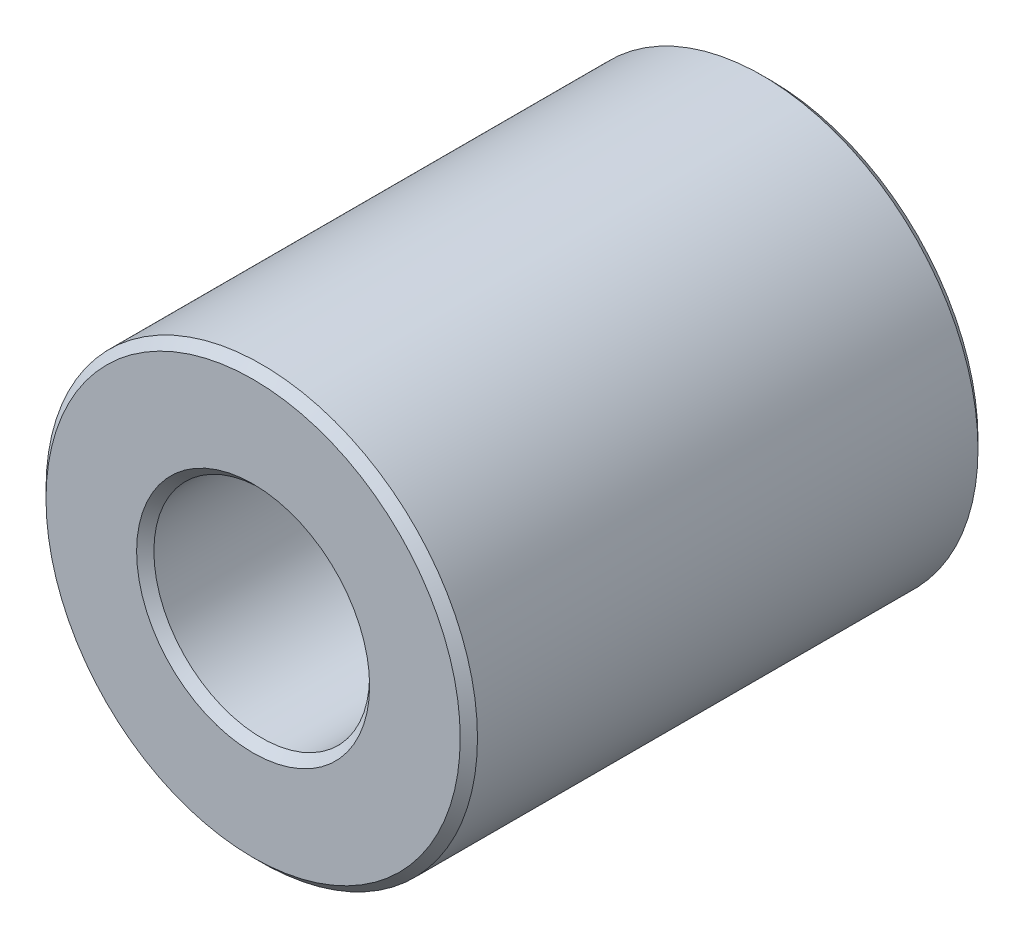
from build123d import *

# Parameters (mm, degrees)
SKETCH1_R           = 2.5
SKETCH1_R_2         = 1.25
BOSS_EXTRUDE2_DEPTH = 3
CHAMFER3_SIZE       = 0.1


with BuildPart() as part:
    # Sketch1 → Boss-Extrude2 (new, symmetric)
    with BuildSketch(Plane.XY):
        Circle(SKETCH1_R)
        Circle(SKETCH1_R_2, mode=Mode.SUBTRACT)
    extrude(amount=BOSS_EXTRUDE2_DEPTH, both=True)

    # Chamfer3
    chamfer3_edges = [part.edges().sort_by_distance(p)[0] for p in [
        (-2.5, 0, -3),
        (-2.5, 0, 3),
        (-1.25, 0, -3),
        (-1.25, 0, 3),
    ]]
    chamfer(chamfer3_edges, length=CHAMFER3_SIZE)


solid = part.part
